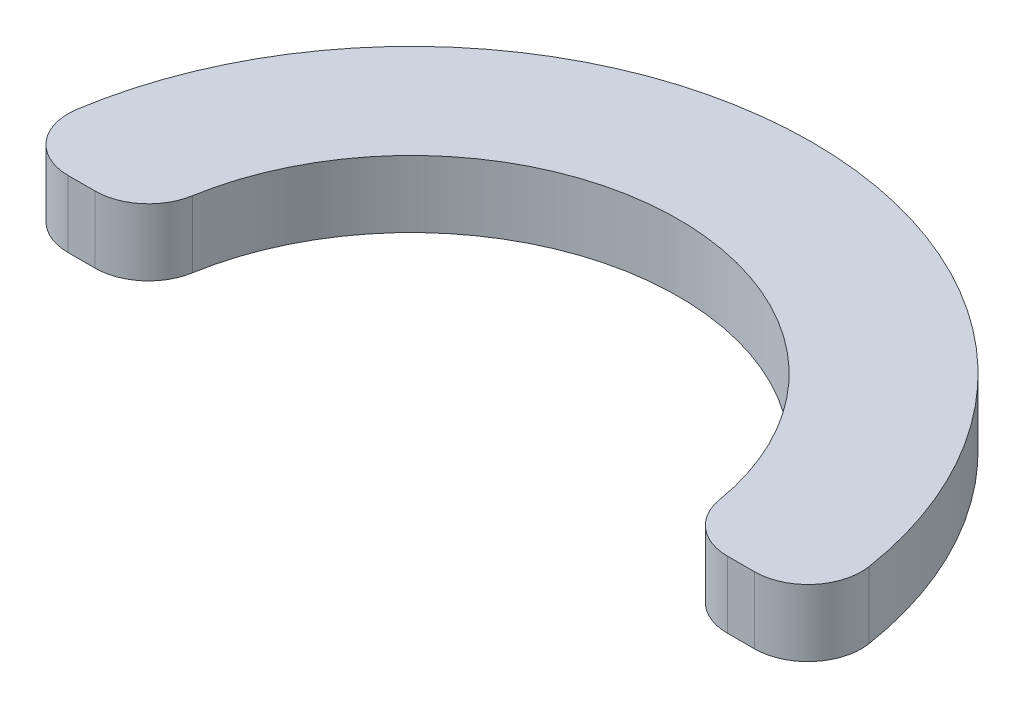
from build123d import *

# Parameters (mm, degrees)
BOSS_EXTRUDE1_DEPTH = 3.175
FILLET1_R           = 2.54


with BuildPart() as part:
    # Sketch1 → Boss-Extrude1 (new body)
    with BuildSketch(Plane(origin=(0, 0, 0), x_dir=(1, 0, 0), z_dir=(0, 1, 0))):
        with BuildLine():
            Line((-12.7, 0), (-19.05, 0))
            ThreePointArc((-19.05, 0), (0, 19.05), (19.05, 0))
            Line((19.05, 0), (12.7, 0))
            ThreePointArc((12.7, 0), (0, 12.7), (-12.7, 0))
        make_face()
    extrude(amount=BOSS_EXTRUDE1_DEPTH)

    # Fillet1
    fillet1_edges = [part.edges().sort_by_distance(p)[0] for p in [
        (-12.7, 1.5875, 0),
        (-19.05, 1.5875, 0),
        (19.05, 1.5875, 0),
        (12.7, 1.5875, 0),
    ]]
    fillet(fillet1_edges, radius=FILLET1_R)


solid = part.part
